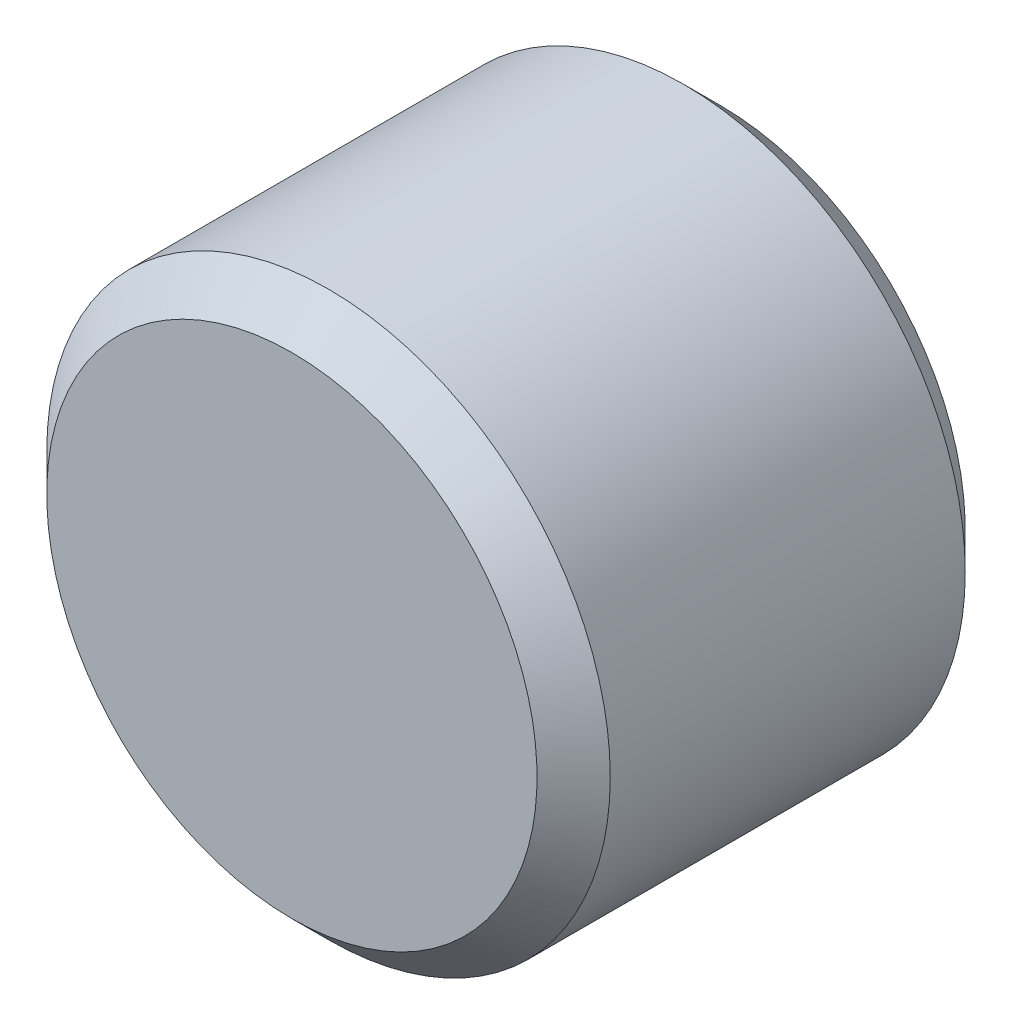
from build123d import *

# Parameters (mm, degrees)
CUT_EXTRUDE1_DEPTH = 6.000001


with BuildPart() as part:
    # Sketch1 → Revolve1 (revolve)
    with BuildSketch(Plane(origin=(0, 0, 0), x_dir=(0, 0, -1), z_dir=(1, 0, 0)), mode=Mode.PRIVATE) as revolve1_sk:
        Polygon((-8.103012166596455, -5.2e-16), (-10, -1.8e-16), (-10, 5.7250000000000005), (-9.145000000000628, 6.580000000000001), (-0.8550000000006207, 6.58), (-3.9e-16, 5.725000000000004), (-9.99000000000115, 5.724999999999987), (-9.99000000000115, 5.715000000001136), (-6.4e-16, 5.715000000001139), (0, 3.5), (-6, 3.500000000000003), align=None)
    revolve(revolve1_sk.sketch.rotate(Axis((0, -1.8e-16, 10), (0, 2e-17, -1)), 180), axis=Axis((0, -1.8e-16, 10), (0, 2e-17, -1)))

    # Sketch2 → Cut-Extrude1 (cut)
    with BuildSketch(Plane.XY):
        Polygon((2.0207259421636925, -3.500000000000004), (4.041451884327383, -5.4e-16), (2.020725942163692, 3.500000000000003), (-2.020725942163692, 3.500000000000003), (-4.041451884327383, -5.4e-16), (-2.0207259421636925, -3.500000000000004), align=None)
    extrude(amount=CUT_EXTRUDE1_DEPTH, mode=Mode.SUBTRACT)


solid = part.part
